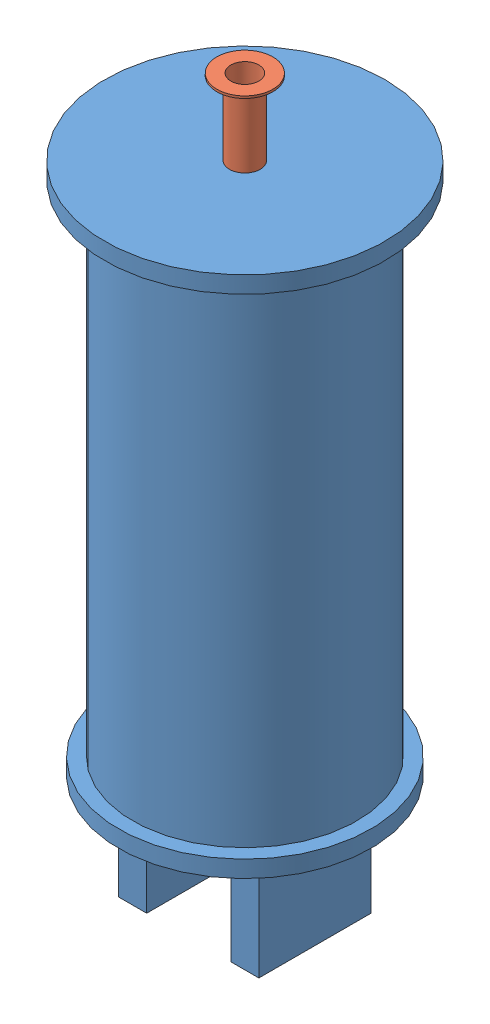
SolidWorks assembly 00.SLDASM, configuration Default (file format 3400). Lengths in mm.
Overall size (1000 2570 1000).
2 component instances, 2 part files, 2 mates.
Components (placement in the parent):
- 01-1: 01.sldprt [Default] at (821.8477 -965.4493 42.6377) size (1000 2300 1000)
- 02-1: 02.sldprt [Default] at (-347.9226 1243.5034 42.6377) size (200 270 200)
Mates (geometry in assembly coordinates):
- Совпадение1: coincident: plane of ?; circle of ?
- Концентрический1: concentric anti-aligned: circle of ?; circle of ?
